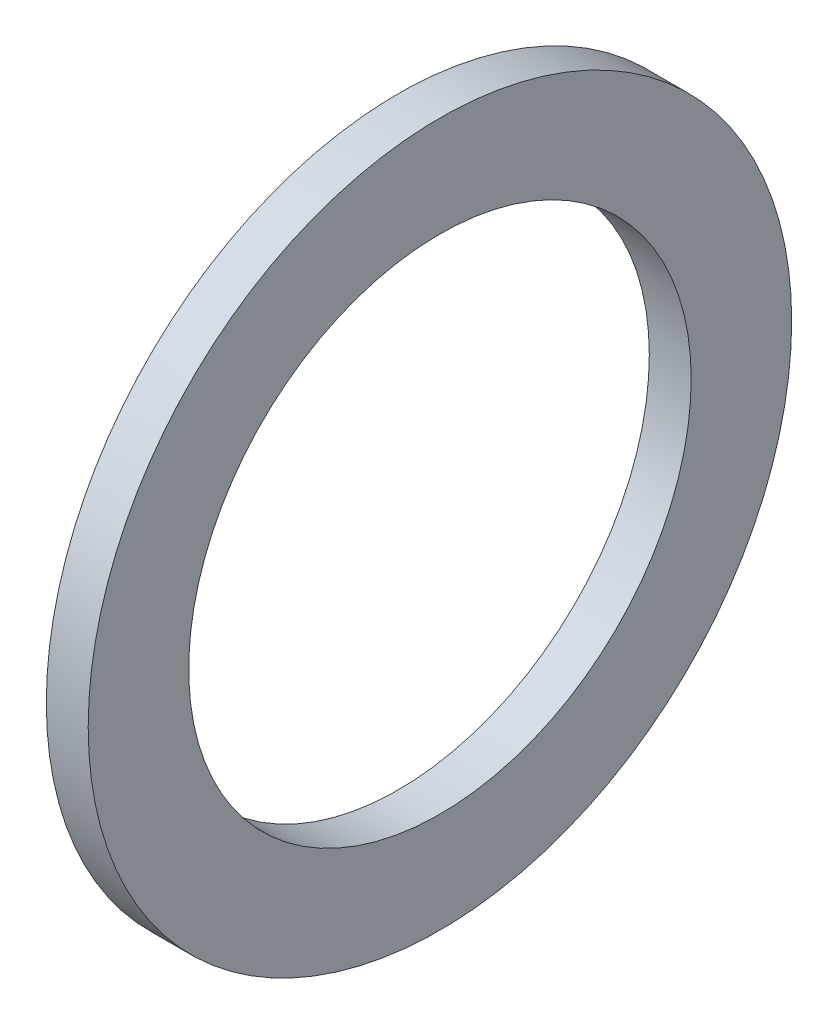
from build123d import *

# Parameters (mm, degrees)
SKIZZE1_W = 2.5
SKIZZE1_H = 6


with BuildPart() as part:
    # Skizze1 → Rotation1 (revolve)
    with BuildSketch(Plane.XY, mode=Mode.PRIVATE) as rotation1_sk:
        with Locations((1.25, 18)):
            Rectangle(SKIZZE1_W, SKIZZE1_H)
    revolve(rotation1_sk.sketch.rotate(Axis((2.5, 0, 0), (-1, 0, 0)), 90), axis=Axis((2.5, 0, 0), (-1, 0, 0)))


solid = part.part
